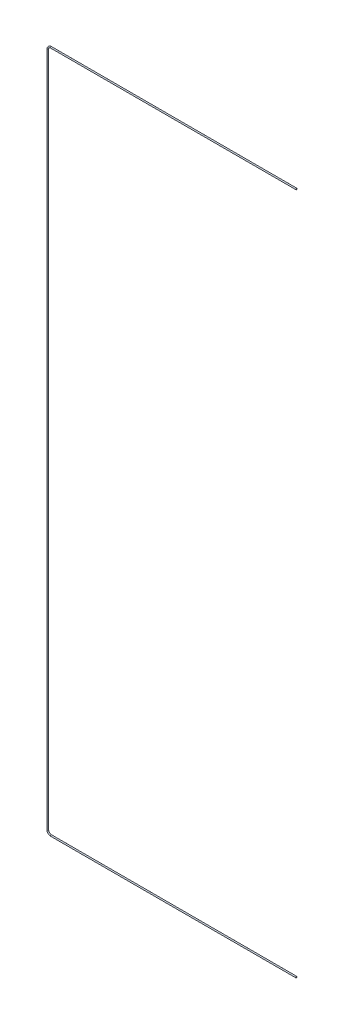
from build123d import *

# Parameters (mm, degrees)
SKETCH7_R = 1.02616


with BuildPart() as part:
    # Sweep1: sweep along a curve in space
    with BuildLine() as sweep1_path:
        Line((0, 0, 0), (-400.05, 0, 0))
        ThreePointArc((-406.4, -6.35, 0), (-404.540128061, -1.859871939, 0), (-400.05, 0, 0))
        Line((-406.4, -6.35, 0), (-406.4, -1108.456, 0))
        ThreePointArc((-406.4, -1108.456, 0), (-404.540128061, -1112.946128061, 0), (-400.05, -1114.806, 0))
        Line((-400.05, -1114.806, 0), (0, -1114.806, 0))
    # Sketch7 → Sweep1 (sweep)
    with BuildSketch(Plane(origin=(0, 0, 0), x_dir=(0, 0, -1), z_dir=(1, 0, 0))):
        with Locations((0, -1.02616)):
            Circle(SKETCH7_R)
    sweep(path=sweep1_path.line)


solid = part.part
